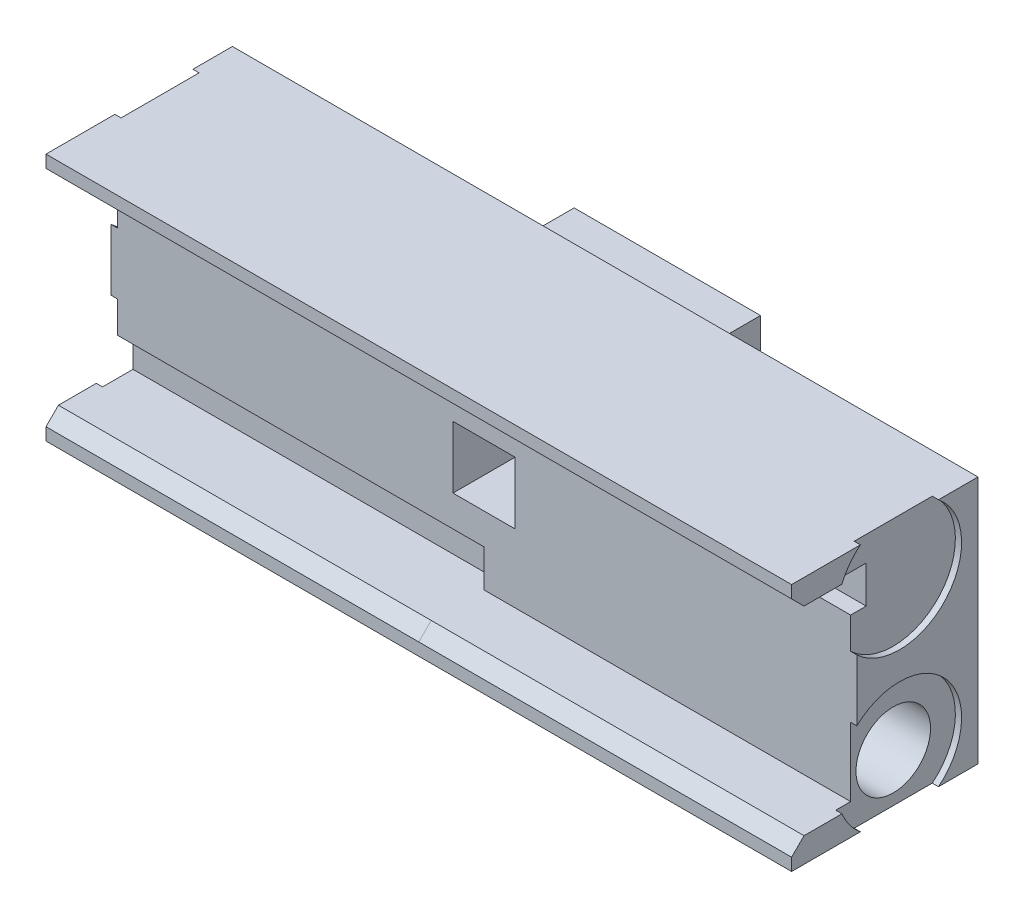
ISO-10303-21;
HEADER;
FILE_DESCRIPTION(('STEP AP214'),'2;1');
FILE_NAME('part.step','',(''),(''),'','','');
FILE_SCHEMA(('AUTOMOTIVE_DESIGN { 1 0 10303 214 1 1 1 1 }'));
ENDSEC;
DATA;
#1=APPLICATION_CONTEXT('core data for automotive mechanical design processes');
#2=APPLICATION_PROTOCOL_DEFINITION('international standard','automotive_design',2000,#1);
#3=PRODUCT_CONTEXT('',#1,'mechanical');
#4=PRODUCT('Part','Part','',(#3));
#5=PRODUCT_RELATED_PRODUCT_CATEGORY('part','',(#4));
#6=PRODUCT_DEFINITION_FORMATION('','',#4);
#7=PRODUCT_DEFINITION_CONTEXT('part definition',#1,'design');
#8=PRODUCT_DEFINITION('design','',#6,#7);
#9=PRODUCT_DEFINITION_SHAPE('','',#8);
#10=(LENGTH_UNIT() NAMED_UNIT(*) SI_UNIT(.MILLI.,.METRE.));
#11=(NAMED_UNIT(*) PLANE_ANGLE_UNIT() SI_UNIT($,.RADIAN.));
#12=(NAMED_UNIT(*) SI_UNIT($,.STERADIAN.) SOLID_ANGLE_UNIT());
#13=UNCERTAINTY_MEASURE_WITH_UNIT(LENGTH_MEASURE(1.E-05),#10,'distance_accuracy_value','');
#14=(GEOMETRIC_REPRESENTATION_CONTEXT(3) GLOBAL_UNCERTAINTY_ASSIGNED_CONTEXT((#13)) GLOBAL_UNIT_ASSIGNED_CONTEXT((#10,
#11,#12)) REPRESENTATION_CONTEXT('',''));
#15=CARTESIAN_POINT('',(0.,0.,0.));
#16=DIRECTION('',(0.,0.,1.));
#17=DIRECTION('',(1.,0.,0.));
#18=AXIS2_PLACEMENT_3D('',#15,#16,#17);
#19=CARTESIAN_POINT('',(-60.,20.,30.));
#20=DIRECTION('',(1.,0.,0.));
#21=DIRECTION('',(0.,0.,-1.));
#22=AXIS2_PLACEMENT_3D('',#19,#20,#21);
#23=PLANE('',#22);
#24=DIRECTION('',(0.,-1.,0.));
#25=VECTOR('',#24,1.);
#26=CARTESIAN_POINT('',(-60.,20.,30.));
#27=LINE('',#26,#25);
#28=CARTESIAN_POINT('',(-60.,-18.,30.));
#29=VERTEX_POINT('',#28);
#30=CARTESIAN_POINT('',(-60.,-20.,30.));
#31=VERTEX_POINT('',#30);
#32=EDGE_CURVE('E364',#29,#31,#27,.T.);
#33=ORIENTED_EDGE('',*,*,#32,.F.);
#34=DIRECTION('',(0.,0.707106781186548,-0.707106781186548));
#35=VECTOR('',#34,1.);
#36=CARTESIAN_POINT('',(-60.,-18.,30.));
#37=LINE('',#36,#35);
#38=CARTESIAN_POINT('',(-60.,-16.,28.));
#39=VERTEX_POINT('',#38);
#40=EDGE_CURVE('E458',#29,#39,#37,.T.);
#41=ORIENTED_EDGE('',*,*,#40,.T.);
#42=DIRECTION('',(0.,0.,1.));
#43=VECTOR('',#42,1.);
#44=CARTESIAN_POINT('',(-60.,-16.,30.));
#45=LINE('',#44,#43);
#46=CARTESIAN_POINT('',(-60.,-16.,21.8987230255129));
#47=VERTEX_POINT('',#46);
#48=EDGE_CURVE('E328',#47,#39,#45,.T.);
#49=ORIENTED_EDGE('',*,*,#48,.F.);
#50=CARTESIAN_POINT('',(-60.,-12.2191674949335,12.6410070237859));
#51=DIRECTION('',(1.,0.,0.));
#52=DIRECTION('',(0.,0.,1.));
#53=AXIS2_PLACEMENT_3D('',#50,#51,#52);
#54=CIRCLE('',#53,10.);
#55=CARTESIAN_POINT('',(-60.,-20.,18.9226187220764));
#56=VERTEX_POINT('',#55);
#57=EDGE_CURVE('E527',#47,#56,#54,.T.);
#58=ORIENTED_EDGE('',*,*,#57,.T.);
#59=DIRECTION('',(0.,0.,-1.));
#60=VECTOR('',#59,1.);
#61=CARTESIAN_POINT('',(-60.,-20.,30.));
#62=LINE('',#61,#60);
#63=EDGE_CURVE('E385',#31,#56,#62,.T.);
#64=ORIENTED_EDGE('',*,*,#63,.F.);
#65=EDGE_LOOP('',(#33,#41,#49,#58,#64));
#66=FACE_BOUND('',#65,.T.);
#67=ADVANCED_FACE('F35',(#66),#23,.F.);
#68=CARTESIAN_POINT('',(-60.,-20.,6.3593953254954));
#69=VERTEX_POINT('',#68);
#70=CARTESIAN_POINT('',(-60.,-4.94220278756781,19.5));
#71=VERTEX_POINT('',#70);
#72=EDGE_CURVE('E540',#69,#71,#54,.T.);
#73=ORIENTED_EDGE('',*,*,#72,.T.);
#74=DIRECTION('',(0.,-1.,0.));
#75=VECTOR('',#74,1.);
#76=CARTESIAN_POINT('',(-60.,-10.,19.5));
#77=LINE('',#76,#75);
#78=CARTESIAN_POINT('',(-60.,4.94220278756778,19.5));
#79=VERTEX_POINT('',#78);
#80=EDGE_CURVE('E469',#79,#71,#77,.T.);
#81=ORIENTED_EDGE('',*,*,#80,.F.);
#82=CARTESIAN_POINT('',(-60.,12.2191674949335,12.6410070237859));
#83=DIRECTION('',(1.,0.,0.));
#84=DIRECTION('',(0.,0.,-1.));
#85=AXIS2_PLACEMENT_3D('',#82,#83,#84);
#86=CIRCLE('',#85,10.);
#87=CARTESIAN_POINT('',(-60.,20.,6.3593953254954));
#88=VERTEX_POINT('',#87);
#89=EDGE_CURVE('E429',#88,#79,#86,.F.);
#90=ORIENTED_EDGE('',*,*,#89,.F.);
#91=DIRECTION('',(0.,0.,-1.));
#92=VECTOR('',#91,1.);
#93=CARTESIAN_POINT('',(-60.,20.,30.));
#94=LINE('',#93,#92);
#95=CARTESIAN_POINT('',(-60.,20.,0.));
#96=VERTEX_POINT('',#95);
#97=EDGE_CURVE('E388',#88,#96,#94,.T.);
#98=ORIENTED_EDGE('',*,*,#97,.T.);
#99=DIRECTION('',(0.,-1.,0.));
#100=VECTOR('',#99,1.);
#101=CARTESIAN_POINT('',(-60.,20.,0.));
#102=LINE('',#101,#100);
#103=CARTESIAN_POINT('',(-60.,-20.,0.));
#104=VERTEX_POINT('',#103);
#105=EDGE_CURVE('E375',#96,#104,#102,.T.);
#106=ORIENTED_EDGE('',*,*,#105,.T.);
#107=EDGE_CURVE('E384',#69,#104,#62,.T.);
#108=ORIENTED_EDGE('',*,*,#107,.F.);
#109=EDGE_LOOP('',(#73,#81,#90,#98,#106,#108));
#110=FACE_BOUND('',#109,.T.);
#111=ADVANCED_FACE('F673',(#110),#23,.F.);
#112=CARTESIAN_POINT('',(0.,0.,30.));
#113=DIRECTION('',(0.,0.,1.));
#114=DIRECTION('',(1.,0.,0.));
#115=AXIS2_PLACEMENT_3D('',#112,#113,#114);
#116=PLANE('',#115);
#117=DIRECTION('',(-1.,0.,0.));
#118=VECTOR('',#117,1.);
#119=CARTESIAN_POINT('',(0.,-18.0000000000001,30.));
#120=LINE('',#119,#118);
#121=CARTESIAN_POINT('',(60.,-18.0000000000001,30.));
#122=VERTEX_POINT('',#121);
#123=CARTESIAN_POINT('',(0.,-18.0000000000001,29.9999999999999));
#124=VERTEX_POINT('',#123);
#125=EDGE_CURVE('E407',#122,#124,#120,.T.);
#126=ORIENTED_EDGE('',*,*,#125,.T.);
#127=DIRECTION('',(-1.,0.,0.));
#128=VECTOR('',#127,1.);
#129=CARTESIAN_POINT('',(-60.,-18.,30.));
#130=LINE('',#129,#128);
#131=EDGE_CURVE('E455',#124,#29,#130,.T.);
#132=ORIENTED_EDGE('',*,*,#131,.T.);
#133=ORIENTED_EDGE('',*,*,#32,.T.);
#134=DIRECTION('',(1.,0.,0.));
#135=VECTOR('',#134,1.);
#136=CARTESIAN_POINT('',(-60.,-20.,30.));
#137=LINE('',#136,#135);
#138=CARTESIAN_POINT('',(60.,-20.,30.));
#139=VERTEX_POINT('',#138);
#140=EDGE_CURVE('E367',#31,#139,#137,.T.);
#141=ORIENTED_EDGE('',*,*,#140,.T.);
#142=DIRECTION('',(0.,1.,0.));
#143=VECTOR('',#142,1.);
#144=CARTESIAN_POINT('',(60.,20.,30.));
#145=LINE('',#144,#143);
#146=EDGE_CURVE('E358',#139,#122,#145,.T.);
#147=ORIENTED_EDGE('',*,*,#146,.T.);
#148=EDGE_LOOP('',(#126,#132,#133,#141,#147));
#149=FACE_BOUND('',#148,.T.);
#150=ADVANCED_FACE('F746',(#149),#116,.T.);
#151=CARTESIAN_POINT('',(0.,0.,0.));
#152=DIRECTION('',(1.,0.,0.));
#153=DIRECTION('',(0.,0.,-1.));
#154=AXIS2_PLACEMENT_3D('',#151,#152,#153);
#155=PLANE('',#154);
#156=DIRECTION('',(0.,-1.,0.));
#157=VECTOR('',#156,1.);
#158=CARTESIAN_POINT('',(0.,-10.,19.5));
#159=LINE('',#158,#157);
#160=CARTESIAN_POINT('',(0.,16.,19.5));
#161=VERTEX_POINT('',#160);
#162=CARTESIAN_POINT('',(0.,9.99999999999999,19.5));
#163=VERTEX_POINT('',#162);
#164=EDGE_CURVE('E317',#161,#163,#159,.T.);
#165=ORIENTED_EDGE('',*,*,#164,.T.);
#166=DIRECTION('',(0.,0.,-1.));
#167=VECTOR('',#166,1.);
#168=CARTESIAN_POINT('',(0.,9.99999999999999,17.));
#169=LINE('',#168,#167);
#170=CARTESIAN_POINT('',(0.,9.99999999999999,17.));
#171=VERTEX_POINT('',#170);
#172=EDGE_CURVE('E338',#163,#171,#169,.T.);
#173=ORIENTED_EDGE('',*,*,#172,.T.);
#174=DIRECTION('',(0.,1.,0.));
#175=VECTOR('',#174,1.);
#176=CARTESIAN_POINT('',(0.,16.,17.));
#177=LINE('',#176,#175);
#178=CARTESIAN_POINT('',(0.,16.,17.));
#179=VERTEX_POINT('',#178);
#180=EDGE_CURVE('E333',#171,#179,#177,.T.);
#181=ORIENTED_EDGE('',*,*,#180,.T.);
#182=DIRECTION('',(0.,0.,1.));
#183=VECTOR('',#182,1.);
#184=CARTESIAN_POINT('',(0.,16.,30.));
#185=LINE('',#184,#183);
#186=EDGE_CURVE('E308',#179,#161,#185,.T.);
#187=ORIENTED_EDGE('',*,*,#186,.T.);
#188=EDGE_LOOP('',(#165,#173,#181,#187));
#189=FACE_BOUND('',#188,.T.);
#190=ADVANCED_FACE('F331',(#189),#155,.T.);
#191=CARTESIAN_POINT('',(-59.,12.2191674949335,12.6410070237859));
#192=DIRECTION('',(-1.,0.,0.));
#193=DIRECTION('',(0.,0.,1.));
#194=AXIS2_PLACEMENT_3D('',#191,#192,#193);
#195=CYLINDRICAL_SURFACE('',#194,10.);
#196=DIRECTION('',(-1.,0.,0.));
#197=VECTOR('',#196,1.);
#198=CARTESIAN_POINT('',(-59.,4.94220278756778,19.5));
#199=LINE('',#198,#197);
#200=CARTESIAN_POINT('',(-59.,4.94220278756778,19.5));
#201=VERTEX_POINT('',#200);
#202=EDGE_CURVE('E494',#201,#79,#199,.T.);
#203=ORIENTED_EDGE('',*,*,#202,.F.);
#204=CARTESIAN_POINT('',(-59.,12.2191674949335,12.6410070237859));
#205=DIRECTION('',(1.,0.,0.));
#206=DIRECTION('',(0.,0.,-1.));
#207=AXIS2_PLACEMENT_3D('',#204,#205,#206);
#208=CIRCLE('',#207,10.);
#209=CARTESIAN_POINT('',(-59.,20.,6.3593953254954));
#210=VERTEX_POINT('',#209);
#211=EDGE_CURVE('E538',#201,#210,#208,.T.);
#212=ORIENTED_EDGE('',*,*,#211,.T.);
#213=DIRECTION('',(-1.,0.,0.));
#214=VECTOR('',#213,1.);
#215=CARTESIAN_POINT('',(-59.,20.,6.3593953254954));
#216=LINE('',#215,#214);
#217=EDGE_CURVE('E546',#210,#88,#216,.T.);
#218=ORIENTED_EDGE('',*,*,#217,.T.);
#219=ORIENTED_EDGE('',*,*,#89,.T.);
#220=EDGE_LOOP('',(#203,#212,#218,#219));
#221=FACE_BOUND('',#220,.T.);
#222=ADVANCED_FACE('F669',(#221),#195,.F.);
#223=CARTESIAN_POINT('',(-59.,-12.2191674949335,12.6410070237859));
#224=DIRECTION('',(-1.,0.,0.));
#225=DIRECTION('',(0.,0.,1.));
#226=AXIS2_PLACEMENT_3D('',#223,#224,#225);
#227=CYLINDRICAL_SURFACE('',#226,10.);
#228=DIRECTION('',(-1.,0.,0.));
#229=VECTOR('',#228,1.);
#230=CARTESIAN_POINT('',(-59.,-16.,21.8987230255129));
#231=LINE('',#230,#229);
#232=CARTESIAN_POINT('',(-59.,-16.,21.8987230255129));
#233=VERTEX_POINT('',#232);
#234=EDGE_CURVE('E498',#233,#47,#231,.T.);
#235=ORIENTED_EDGE('',*,*,#234,.F.);
#236=CARTESIAN_POINT('',(-59.,-12.2191674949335,12.6410070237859));
#237=DIRECTION('',(1.,0.,0.));
#238=DIRECTION('',(0.,0.,1.));
#239=AXIS2_PLACEMENT_3D('',#236,#237,#238);
#240=CIRCLE('',#239,10.);
#241=CARTESIAN_POINT('',(-59.,-20.,18.9226187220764));
#242=VERTEX_POINT('',#241);
#243=EDGE_CURVE('E539',#233,#242,#240,.T.);
#244=ORIENTED_EDGE('',*,*,#243,.T.);
#245=DIRECTION('',(-1.,0.,0.));
#246=VECTOR('',#245,1.);
#247=CARTESIAN_POINT('',(-59.,-20.,18.9226187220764));
#248=LINE('',#247,#246);
#249=EDGE_CURVE('E438',#242,#56,#248,.T.);
#250=ORIENTED_EDGE('',*,*,#249,.T.);
#251=ORIENTED_EDGE('',*,*,#57,.F.);
#252=EDGE_LOOP('',(#235,#244,#250,#251));
#253=FACE_BOUND('',#252,.T.);
#254=ADVANCED_FACE('F786',(#253),#227,.F.);
#255=CARTESIAN_POINT('',(-60.,-20.,30.));
#256=DIRECTION('',(0.,1.,0.));
#257=DIRECTION('',(0.,0.,1.));
#258=AXIS2_PLACEMENT_3D('',#255,#256,#257);
#259=PLANE('',#258);
#260=DIRECTION('',(-1.,0.,0.));
#261=VECTOR('',#260,1.);
#262=CARTESIAN_POINT('',(-59.,-20.,6.3593953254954));
#263=LINE('',#262,#261);
#264=CARTESIAN_POINT('',(-59.,-20.,6.3593953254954));
#265=VERTEX_POINT('',#264);
#266=EDGE_CURVE('E441',#69,#265,#263,.F.);
#267=ORIENTED_EDGE('',*,*,#266,.F.);
#268=ORIENTED_EDGE('',*,*,#107,.T.);
#269=DIRECTION('',(1.,0.,0.));
#270=VECTOR('',#269,1.);
#271=CARTESIAN_POINT('',(-60.,-20.,0.));
#272=LINE('',#271,#270);
#273=CARTESIAN_POINT('',(60.,-20.,0.));
#274=VERTEX_POINT('',#273);
#275=EDGE_CURVE('E378',#104,#274,#272,.T.);
#276=ORIENTED_EDGE('',*,*,#275,.T.);
#277=DIRECTION('',(0.,0.,-1.));
#278=VECTOR('',#277,1.);
#279=CARTESIAN_POINT('',(60.,-20.,30.));
#280=LINE('',#279,#278);
#281=CARTESIAN_POINT('',(60.,-20.,6.3593953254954));
#282=VERTEX_POINT('',#281);
#283=EDGE_CURVE('E369',#282,#274,#280,.T.);
#284=ORIENTED_EDGE('',*,*,#283,.F.);
#285=DIRECTION('',(1.,0.,0.));
#286=VECTOR('',#285,1.);
#287=CARTESIAN_POINT('',(59.,-20.,6.3593953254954));
#288=LINE('',#287,#286);
#289=CARTESIAN_POINT('',(59.,-20.,6.3593953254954));
#290=VERTEX_POINT('',#289);
#291=EDGE_CURVE('E566',#282,#290,#288,.F.);
#292=ORIENTED_EDGE('',*,*,#291,.T.);
#293=DIRECTION('',(0.,0.,1.));
#294=VECTOR('',#293,1.);
#295=CARTESIAN_POINT('',(59.,-20.,30.));
#296=LINE('',#295,#294);
#297=CARTESIAN_POINT('',(59.,-20.,18.9226187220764));
#298=VERTEX_POINT('',#297);
#299=EDGE_CURVE('E560',#290,#298,#296,.T.);
#300=ORIENTED_EDGE('',*,*,#299,.T.);
#301=DIRECTION('',(1.,0.,0.));
#302=VECTOR('',#301,1.);
#303=CARTESIAN_POINT('',(59.,-20.,18.9226187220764));
#304=LINE('',#303,#302);
#305=CARTESIAN_POINT('',(60.,-20.,18.9226187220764));
#306=VERTEX_POINT('',#305);
#307=EDGE_CURVE('E569',#298,#306,#304,.T.);
#308=ORIENTED_EDGE('',*,*,#307,.T.);
#309=EDGE_CURVE('E381',#139,#306,#280,.T.);
#310=ORIENTED_EDGE('',*,*,#309,.F.);
#311=ORIENTED_EDGE('',*,*,#140,.F.);
#312=ORIENTED_EDGE('',*,*,#63,.T.);
#313=ORIENTED_EDGE('',*,*,#249,.F.);
#314=DIRECTION('',(0.,0.,-1.));
#315=VECTOR('',#314,1.);
#316=CARTESIAN_POINT('',(-59.,-20.,30.));
#317=LINE('',#316,#315);
#318=EDGE_CURVE('E435',#242,#265,#317,.T.);
#319=ORIENTED_EDGE('',*,*,#318,.T.);
#320=EDGE_LOOP('',(#267,#268,#276,#284,#292,#300,#308,#310,#311,#312,#313,#319));
#321=FACE_BOUND('',#320,.T.);
#322=ADVANCED_FACE('F685',(#321),#259,.F.);
#323=CARTESIAN_POINT('',(-60.,20.,30.));
#324=DIRECTION('',(0.,-1.,0.));
#325=DIRECTION('',(0.,0.,-1.));
#326=AXIS2_PLACEMENT_3D('',#323,#324,#325);
#327=PLANE('',#326);
#328=DIRECTION('',(-1.,0.,0.));
#329=VECTOR('',#328,1.);
#330=CARTESIAN_POINT('',(-59.,20.,18.9226187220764));
#331=LINE('',#330,#329);
#332=CARTESIAN_POINT('',(-60.,20.,18.9226187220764));
#333=VERTEX_POINT('',#332);
#334=CARTESIAN_POINT('',(-59.,20.,18.9226187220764));
#335=VERTEX_POINT('',#334);
#336=EDGE_CURVE('E548',#333,#335,#331,.F.);
#337=ORIENTED_EDGE('',*,*,#336,.F.);
#338=CARTESIAN_POINT('',(-60.,20.,30.));
#339=VERTEX_POINT('',#338);
#340=EDGE_CURVE('E389',#339,#333,#94,.T.);
#341=ORIENTED_EDGE('',*,*,#340,.F.);
#342=DIRECTION('',(-1.,0.,0.));
#343=VECTOR('',#342,1.);
#344=CARTESIAN_POINT('',(-60.,20.,30.));
#345=LINE('',#344,#343);
#346=CARTESIAN_POINT('',(60.,20.,30.));
#347=VERTEX_POINT('',#346);
#348=EDGE_CURVE('E361',#347,#339,#345,.T.);
#349=ORIENTED_EDGE('',*,*,#348,.F.);
#350=DIRECTION('',(0.,0.,-1.));
#351=VECTOR('',#350,1.);
#352=CARTESIAN_POINT('',(60.,20.,30.));
#353=LINE('',#352,#351);
#354=CARTESIAN_POINT('',(60.,20.,18.9226187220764));
#355=VERTEX_POINT('',#354);
#356=EDGE_CURVE('E393',#347,#355,#353,.T.);
#357=ORIENTED_EDGE('',*,*,#356,.T.);
#358=DIRECTION('',(1.,0.,0.));
#359=VECTOR('',#358,1.);
#360=CARTESIAN_POINT('',(59.,20.,18.9226187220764));
#361=LINE('',#360,#359);
#362=CARTESIAN_POINT('',(59.,20.,18.9226187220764));
#363=VERTEX_POINT('',#362);
#364=EDGE_CURVE('E590',#355,#363,#361,.F.);
#365=ORIENTED_EDGE('',*,*,#364,.T.);
#366=DIRECTION('',(0.,0.,1.));
#367=VECTOR('',#366,1.);
#368=CARTESIAN_POINT('',(59.,20.,30.));
#369=LINE('',#368,#367);
#370=CARTESIAN_POINT('',(59.,20.,6.3593953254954));
#371=VERTEX_POINT('',#370);
#372=EDGE_CURVE('E585',#371,#363,#369,.T.);
#373=ORIENTED_EDGE('',*,*,#372,.F.);
#374=DIRECTION('',(1.,0.,0.));
#375=VECTOR('',#374,1.);
#376=CARTESIAN_POINT('',(59.,20.,6.3593953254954));
#377=LINE('',#376,#375);
#378=CARTESIAN_POINT('',(60.,20.,6.3593953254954));
#379=VERTEX_POINT('',#378);
#380=EDGE_CURVE('E593',#371,#379,#377,.T.);
#381=ORIENTED_EDGE('',*,*,#380,.T.);
#382=CARTESIAN_POINT('',(60.,20.,0.));
#383=VERTEX_POINT('',#382);
#384=EDGE_CURVE('E392',#379,#383,#353,.T.);
#385=ORIENTED_EDGE('',*,*,#384,.T.);
#386=DIRECTION('',(-1.,0.,0.));
#387=VECTOR('',#386,1.);
#388=CARTESIAN_POINT('',(-60.,20.,0.));
#389=LINE('',#388,#387);
#390=EDGE_CURVE('E372',#383,#96,#389,.T.);
#391=ORIENTED_EDGE('',*,*,#390,.T.);
#392=ORIENTED_EDGE('',*,*,#97,.F.);
#393=ORIENTED_EDGE('',*,*,#217,.F.);
#394=DIRECTION('',(0.,0.,-1.));
#395=VECTOR('',#394,1.);
#396=CARTESIAN_POINT('',(-59.,20.,30.));
#397=LINE('',#396,#395);
#398=EDGE_CURVE('E432',#335,#210,#397,.T.);
#399=ORIENTED_EDGE('',*,*,#398,.F.);
#400=EDGE_LOOP('',(#337,#341,#349,#357,#365,#373,#381,#385,#391,#392,#393,#399));
#401=FACE_BOUND('',#400,.T.);
#402=ADVANCED_FACE('F646',(#401),#327,.F.);
#403=CARTESIAN_POINT('',(60.,20.,30.));
#404=DIRECTION('',(-1.,0.,0.));
#405=DIRECTION('',(0.,0.,1.));
#406=AXIS2_PLACEMENT_3D('',#403,#404,#405);
#407=PLANE('',#406);
#408=DIRECTION('',(0.,1.,0.));
#409=VECTOR('',#408,1.);
#410=CARTESIAN_POINT('',(60.,9.99999999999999,19.5));
#411=LINE('',#410,#409);
#412=CARTESIAN_POINT('',(60.,-4.94220278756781,19.5));
#413=VERTEX_POINT('',#412);
#414=CARTESIAN_POINT('',(60.,4.94220278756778,19.5));
#415=VERTEX_POINT('',#414);
#416=EDGE_CURVE('E345',#413,#415,#411,.T.);
#417=ORIENTED_EDGE('',*,*,#416,.F.);
#418=CARTESIAN_POINT('',(60.,-12.2191674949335,12.6410070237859));
#419=DIRECTION('',(1.,0.,0.));
#420=DIRECTION('',(0.,0.,1.));
#421=AXIS2_PLACEMENT_3D('',#418,#419,#420);
#422=CIRCLE('',#421,10.);
#423=EDGE_CURVE('E550',#282,#413,#422,.T.);
#424=ORIENTED_EDGE('',*,*,#423,.F.);
#425=ORIENTED_EDGE('',*,*,#283,.T.);
#426=DIRECTION('',(0.,1.,0.));
#427=VECTOR('',#426,1.);
#428=CARTESIAN_POINT('',(60.,20.,0.));
#429=LINE('',#428,#427);
#430=EDGE_CURVE('E353',#274,#383,#429,.T.);
#431=ORIENTED_EDGE('',*,*,#430,.T.);
#432=ORIENTED_EDGE('',*,*,#384,.F.);
#433=CARTESIAN_POINT('',(60.,12.2191674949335,12.6410070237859));
#434=DIRECTION('',(1.,0.,0.));
#435=DIRECTION('',(0.,0.,-1.));
#436=AXIS2_PLACEMENT_3D('',#433,#434,#435);
#437=CIRCLE('',#436,10.);
#438=EDGE_CURVE('E572',#415,#379,#437,.T.);
#439=ORIENTED_EDGE('',*,*,#438,.F.);
#440=EDGE_LOOP('',(#417,#424,#425,#431,#432,#439));
#441=FACE_BOUND('',#440,.T.);
#442=ADVANCED_FACE('F759',(#441),#407,.F.);
#443=DIRECTION('',(0.,0.,1.));
#444=VECTOR('',#443,1.);
#445=CARTESIAN_POINT('',(60.,16.,30.));
#446=LINE('',#445,#444);
#447=CARTESIAN_POINT('',(60.,16.,21.8987230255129));
#448=VERTEX_POINT('',#447);
#449=CARTESIAN_POINT('',(60.,16.,28.));
#450=VERTEX_POINT('',#449);
#451=EDGE_CURVE('E348',#448,#450,#446,.T.);
#452=ORIENTED_EDGE('',*,*,#451,.F.);
#453=EDGE_CURVE('E577',#355,#448,#437,.T.);
#454=ORIENTED_EDGE('',*,*,#453,.F.);
#455=ORIENTED_EDGE('',*,*,#356,.F.);
#456=CARTESIAN_POINT('',(60.,18.,30.));
#457=VERTEX_POINT('',#456);
#458=EDGE_CURVE('E362',#457,#347,#145,.T.);
#459=ORIENTED_EDGE('',*,*,#458,.F.);
#460=DIRECTION('',(0.,-0.707106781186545,-0.70710678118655));
#461=VECTOR('',#460,1.);
#462=CARTESIAN_POINT('',(60.,18.,30.));
#463=LINE('',#462,#461);
#464=EDGE_CURVE('E399',#457,#450,#463,.T.);
#465=ORIENTED_EDGE('',*,*,#464,.T.);
#466=EDGE_LOOP('',(#452,#454,#455,#459,#465));
#467=FACE_BOUND('',#466,.T.);
#468=ADVANCED_FACE('F652',(#467),#407,.F.);
#469=CARTESIAN_POINT('',(0.,16.,17.));
#470=DIRECTION('',(0.,0.,-1.));
#471=DIRECTION('',(0.,1.,0.));
#472=AXIS2_PLACEMENT_3D('',#469,#470,#471);
#473=PLANE('',#472);
#474=DIRECTION('',(0.,-1.,0.));
#475=VECTOR('',#474,1.);
#476=CARTESIAN_POINT('',(59.,16.,17.));
#477=LINE('',#476,#475);
#478=CARTESIAN_POINT('',(59.,16.,17.));
#479=VERTEX_POINT('',#478);
#480=CARTESIAN_POINT('',(59.,9.99999999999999,17.));
#481=VERTEX_POINT('',#480);
#482=EDGE_CURVE('E581',#479,#481,#477,.T.);
#483=ORIENTED_EDGE('',*,*,#482,.F.);
#484=DIRECTION('',(1.,0.,0.));
#485=VECTOR('',#484,1.);
#486=CARTESIAN_POINT('',(0.,16.,17.));
#487=LINE('',#486,#485);
#488=EDGE_CURVE('E351',#179,#479,#487,.T.);
#489=ORIENTED_EDGE('',*,*,#488,.F.);
#490=ORIENTED_EDGE('',*,*,#180,.F.);
#491=DIRECTION('',(1.,0.,0.));
#492=VECTOR('',#491,1.);
#493=CARTESIAN_POINT('',(0.,9.99999999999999,17.));
#494=LINE('',#493,#492);
#495=EDGE_CURVE('E354',#171,#481,#494,.T.);
#496=ORIENTED_EDGE('',*,*,#495,.T.);
#497=EDGE_LOOP('',(#483,#489,#490,#496));
#498=FACE_BOUND('',#497,.T.);
#499=ADVANCED_FACE('F633',(#498),#473,.F.);
#500=CARTESIAN_POINT('',(0.,9.99999999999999,17.));
#501=DIRECTION('',(0.,-1.,0.));
#502=DIRECTION('',(0.,0.,-1.));
#503=AXIS2_PLACEMENT_3D('',#500,#501,#502);
#504=PLANE('',#503);
#505=DIRECTION('',(0.,0.,1.));
#506=VECTOR('',#505,1.);
#507=CARTESIAN_POINT('',(59.,9.99999999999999,17.));
#508=LINE('',#507,#506);
#509=CARTESIAN_POINT('',(59.,9.99999999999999,19.5));
#510=VERTEX_POINT('',#509);
#511=EDGE_CURVE('E579',#481,#510,#508,.T.);
#512=ORIENTED_EDGE('',*,*,#511,.F.);
#513=ORIENTED_EDGE('',*,*,#495,.F.);
#514=ORIENTED_EDGE('',*,*,#172,.F.);
#515=DIRECTION('',(1.,0.,0.));
#516=VECTOR('',#515,1.);
#517=CARTESIAN_POINT('',(0.,9.99999999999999,19.5));
#518=LINE('',#517,#516);
#519=EDGE_CURVE('E323',#163,#510,#518,.T.);
#520=ORIENTED_EDGE('',*,*,#519,.T.);
#521=EDGE_LOOP('',(#512,#513,#514,#520));
#522=FACE_BOUND('',#521,.T.);
#523=ADVANCED_FACE('F630',(#522),#504,.F.);
#524=CARTESIAN_POINT('',(0.,0.,0.));
#525=DIRECTION('',(0.,0.,1.));
#526=DIRECTION('',(1.,0.,0.));
#527=AXIS2_PLACEMENT_3D('',#524,#525,#526);
#528=PLANE('',#527);
#529=ORIENTED_EDGE('',*,*,#430,.F.);
#530=ORIENTED_EDGE('',*,*,#275,.F.);
#531=ORIENTED_EDGE('',*,*,#105,.F.);
#532=ORIENTED_EDGE('',*,*,#390,.F.);
#533=EDGE_LOOP('',(#529,#530,#531,#532));
#534=FACE_BOUND('',#533,.T.);
#535=DIRECTION('',(0.,1.,0.));
#536=VECTOR('',#535,1.);
#537=CARTESIAN_POINT('',(-15.,15.,0.));
#538=LINE('',#537,#536);
#539=CARTESIAN_POINT('',(-15.,-15.,0.));
#540=VERTEX_POINT('',#539);
#541=CARTESIAN_POINT('',(-15.,15.,0.));
#542=VERTEX_POINT('',#541);
#543=EDGE_CURVE('E596',#540,#542,#538,.T.);
#544=ORIENTED_EDGE('',*,*,#543,.F.);
#545=DIRECTION('',(-1.,0.,0.));
#546=VECTOR('',#545,1.);
#547=CARTESIAN_POINT('',(15.,-15.,0.));
#548=LINE('',#547,#546);
#549=CARTESIAN_POINT('',(15.,-15.,0.));
#550=VERTEX_POINT('',#549);
#551=EDGE_CURVE('E601',#550,#540,#548,.T.);
#552=ORIENTED_EDGE('',*,*,#551,.F.);
#553=DIRECTION('',(0.,-1.,0.));
#554=VECTOR('',#553,1.);
#555=CARTESIAN_POINT('',(15.,15.,0.));
#556=LINE('',#555,#554);
#557=CARTESIAN_POINT('',(15.,15.,0.));
#558=VERTEX_POINT('',#557);
#559=EDGE_CURVE('E613',#558,#550,#556,.T.);
#560=ORIENTED_EDGE('',*,*,#559,.F.);
#561=DIRECTION('',(1.,0.,0.));
#562=VECTOR('',#561,1.);
#563=CARTESIAN_POINT('',(15.,15.,0.));
#564=LINE('',#563,#562);
#565=EDGE_CURVE('E610',#542,#558,#564,.T.);
#566=ORIENTED_EDGE('',*,*,#565,.F.);
#567=EDGE_LOOP('',(#544,#552,#560,#566));
#568=FACE_BOUND('',#567,.T.);
#569=ADVANCED_FACE('F680',(#534,#568),#528,.F.);
#570=ORIENTED_EDGE('',*,*,#309,.T.);
#571=CARTESIAN_POINT('',(60.,-16.,21.8987230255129));
#572=VERTEX_POINT('',#571);
#573=EDGE_CURVE('E556',#572,#306,#422,.T.);
#574=ORIENTED_EDGE('',*,*,#573,.F.);
#575=DIRECTION('',(0.,0.,-1.));
#576=VECTOR('',#575,1.);
#577=CARTESIAN_POINT('',(60.,-16.,29.9999999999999));
#578=LINE('',#577,#576);
#579=CARTESIAN_POINT('',(60.,-16.,27.9999999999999));
#580=VERTEX_POINT('',#579);
#581=EDGE_CURVE('E342',#580,#572,#578,.T.);
#582=ORIENTED_EDGE('',*,*,#581,.F.);
#583=DIRECTION('',(0.,-0.707106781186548,0.707106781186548));
#584=VECTOR('',#583,1.);
#585=CARTESIAN_POINT('',(60.,-16.,27.9999999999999));
#586=LINE('',#585,#584);
#587=EDGE_CURVE('E402',#580,#122,#586,.T.);
#588=ORIENTED_EDGE('',*,*,#587,.T.);
#589=ORIENTED_EDGE('',*,*,#146,.F.);
#590=EDGE_LOOP('',(#570,#574,#582,#588,#589));
#591=FACE_BOUND('',#590,.T.);
#592=ADVANCED_FACE('F751',(#591),#407,.F.);
#593=DIRECTION('',(0.,0.,-1.));
#594=VECTOR('',#593,1.);
#595=CARTESIAN_POINT('',(-60.,16.,19.5));
#596=LINE('',#595,#594);
#597=CARTESIAN_POINT('',(-60.,16.,28.));
#598=VERTEX_POINT('',#597);
#599=CARTESIAN_POINT('',(-60.,16.,21.8987230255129));
#600=VERTEX_POINT('',#599);
#601=EDGE_CURVE('E463',#598,#600,#596,.T.);
#602=ORIENTED_EDGE('',*,*,#601,.F.);
#603=DIRECTION('',(0.,0.70710678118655,0.707106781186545));
#604=VECTOR('',#603,1.);
#605=CARTESIAN_POINT('',(-60.,16.,28.));
#606=LINE('',#605,#604);
#607=CARTESIAN_POINT('',(-60.,18.,30.));
#608=VERTEX_POINT('',#607);
#609=EDGE_CURVE('E43',#598,#608,#606,.T.);
#610=ORIENTED_EDGE('',*,*,#609,.T.);
#611=EDGE_CURVE('E365',#339,#608,#27,.T.);
#612=ORIENTED_EDGE('',*,*,#611,.F.);
#613=ORIENTED_EDGE('',*,*,#340,.T.);
#614=EDGE_CURVE('E428',#600,#333,#86,.F.);
#615=ORIENTED_EDGE('',*,*,#614,.F.);
#616=EDGE_LOOP('',(#602,#610,#612,#613,#615));
#617=FACE_BOUND('',#616,.T.);
#618=ADVANCED_FACE('F468',(#617),#23,.F.);
#619=ORIENTED_EDGE('',*,*,#611,.T.);
#620=DIRECTION('',(1.,0.,0.));
#621=VECTOR('',#620,1.);
#622=CARTESIAN_POINT('',(0.,18.,30.));
#623=LINE('',#622,#621);
#624=CARTESIAN_POINT('',(0.,18.,30.));
#625=VERTEX_POINT('',#624);
#626=EDGE_CURVE('E11',#608,#625,#623,.T.);
#627=ORIENTED_EDGE('',*,*,#626,.T.);
#628=DIRECTION('',(1.,0.,0.));
#629=VECTOR('',#628,1.);
#630=CARTESIAN_POINT('',(60.,18.,30.));
#631=LINE('',#630,#629);
#632=EDGE_CURVE('E404',#625,#457,#631,.T.);
#633=ORIENTED_EDGE('',*,*,#632,.T.);
#634=ORIENTED_EDGE('',*,*,#458,.T.);
#635=ORIENTED_EDGE('',*,*,#348,.T.);
#636=EDGE_LOOP('',(#619,#627,#633,#634,#635));
#637=FACE_BOUND('',#636,.T.);
#638=ADVANCED_FACE('F657',(#637),#116,.T.);
#639=CARTESIAN_POINT('',(0.,16.,30.));
#640=DIRECTION('',(0.,1.,0.));
#641=DIRECTION('',(0.,0.,1.));
#642=AXIS2_PLACEMENT_3D('',#639,#640,#641);
#643=PLANE('',#642);
#644=DIRECTION('',(-1.,0.,0.));
#645=VECTOR('',#644,1.);
#646=CARTESIAN_POINT('',(0.,16.,28.));
#647=LINE('',#646,#645);
#648=CARTESIAN_POINT('',(0.,16.,28.));
#649=VERTEX_POINT('',#648);
#650=EDGE_CURVE('E409',#450,#649,#647,.T.);
#651=ORIENTED_EDGE('',*,*,#650,.T.);
#652=DIRECTION('',(-1.,0.,0.));
#653=VECTOR('',#652,1.);
#654=CARTESIAN_POINT('',(-60.,16.,28.));
#655=LINE('',#654,#653);
#656=EDGE_CURVE('E462',#649,#598,#655,.T.);
#657=ORIENTED_EDGE('',*,*,#656,.T.);
#658=ORIENTED_EDGE('',*,*,#601,.T.);
#659=DIRECTION('',(-1.,0.,0.));
#660=VECTOR('',#659,1.);
#661=CARTESIAN_POINT('',(-59.,16.,21.8987230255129));
#662=LINE('',#661,#660);
#663=CARTESIAN_POINT('',(-59.,16.,21.8987230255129));
#664=VERTEX_POINT('',#663);
#665=EDGE_CURVE('E453',#600,#664,#662,.F.);
#666=ORIENTED_EDGE('',*,*,#665,.T.);
#667=DIRECTION('',(0.,0.,-1.));
#668=VECTOR('',#667,1.);
#669=CARTESIAN_POINT('',(-59.,16.,12.6410070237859));
#670=LINE('',#669,#668);
#671=CARTESIAN_POINT('',(-59.,16.,19.5));
#672=VERTEX_POINT('',#671);
#673=EDGE_CURVE('E310',#664,#672,#670,.T.);
#674=ORIENTED_EDGE('',*,*,#673,.T.);
#675=DIRECTION('',(-1.,0.,0.));
#676=VECTOR('',#675,1.);
#677=CARTESIAN_POINT('',(0.,16.,19.5));
#678=LINE('',#677,#676);
#679=EDGE_CURVE('E303',#161,#672,#678,.T.);
#680=ORIENTED_EDGE('',*,*,#679,.F.);
#681=ORIENTED_EDGE('',*,*,#186,.F.);
#682=ORIENTED_EDGE('',*,*,#488,.T.);
#683=DIRECTION('',(0.,0.,-1.));
#684=VECTOR('',#683,1.);
#685=CARTESIAN_POINT('',(59.,16.,30.));
#686=LINE('',#685,#684);
#687=CARTESIAN_POINT('',(59.,16.,21.8987230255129));
#688=VERTEX_POINT('',#687);
#689=EDGE_CURVE('E583',#688,#479,#686,.T.);
#690=ORIENTED_EDGE('',*,*,#689,.F.);
#691=DIRECTION('',(1.,0.,0.));
#692=VECTOR('',#691,1.);
#693=CARTESIAN_POINT('',(59.,16.,21.8987230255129));
#694=LINE('',#693,#692);
#695=EDGE_CURVE('E587',#688,#448,#694,.T.);
#696=ORIENTED_EDGE('',*,*,#695,.T.);
#697=ORIENTED_EDGE('',*,*,#451,.T.);
#698=EDGE_LOOP('',(#651,#657,#658,#666,#674,#680,#681,#682,#690,#696,#697));
#699=FACE_BOUND('',#698,.T.);
#700=ADVANCED_FACE('F305',(#699),#643,.F.);
#701=CARTESIAN_POINT('',(0.,9.99999999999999,19.5));
#702=DIRECTION('',(0.,0.,-1.));
#703=DIRECTION('',(-1.,0.,0.));
#704=AXIS2_PLACEMENT_3D('',#701,#702,#703);
#705=PLANE('',#704);
#706=DIRECTION('',(-1.,0.,0.));
#707=VECTOR('',#706,1.);
#708=CARTESIAN_POINT('',(0.,-10.,19.5));
#709=LINE('',#708,#707);
#710=CARTESIAN_POINT('',(0.,-10.,19.5));
#711=VERTEX_POINT('',#710);
#712=CARTESIAN_POINT('',(-59.,-10.,19.5));
#713=VERTEX_POINT('',#712);
#714=EDGE_CURVE('E313',#711,#713,#709,.T.);
#715=ORIENTED_EDGE('',*,*,#714,.F.);
#716=DIRECTION('',(0.,1.,0.));
#717=VECTOR('',#716,1.);
#718=CARTESIAN_POINT('',(0.,-9.99999999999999,19.5));
#719=LINE('',#718,#717);
#720=CARTESIAN_POINT('',(0.,-16.,19.5));
#721=VERTEX_POINT('',#720);
#722=EDGE_CURVE('E350',#721,#711,#719,.T.);
#723=ORIENTED_EDGE('',*,*,#722,.F.);
#724=DIRECTION('',(1.,0.,0.));
#725=VECTOR('',#724,1.);
#726=CARTESIAN_POINT('',(0.,-16.,19.5));
#727=LINE('',#726,#725);
#728=CARTESIAN_POINT('',(59.,-16.,19.5));
#729=VERTEX_POINT('',#728);
#730=EDGE_CURVE('E334',#721,#729,#727,.T.);
#731=ORIENTED_EDGE('',*,*,#730,.T.);
#732=DIRECTION('',(0.,1.,0.));
#733=VECTOR('',#732,1.);
#734=CARTESIAN_POINT('',(59.,9.99999999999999,19.5));
#735=LINE('',#734,#733);
#736=CARTESIAN_POINT('',(59.,-4.94220278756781,19.5));
#737=VERTEX_POINT('',#736);
#738=EDGE_CURVE('E554',#729,#737,#735,.T.);
#739=ORIENTED_EDGE('',*,*,#738,.T.);
#740=DIRECTION('',(1.,0.,0.));
#741=VECTOR('',#740,1.);
#742=CARTESIAN_POINT('',(59.,-4.94220278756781,19.5));
#743=LINE('',#742,#741);
#744=EDGE_CURVE('E563',#737,#413,#743,.T.);
#745=ORIENTED_EDGE('',*,*,#744,.T.);
#746=ORIENTED_EDGE('',*,*,#416,.T.);
#747=DIRECTION('',(1.,0.,0.));
#748=VECTOR('',#747,1.);
#749=CARTESIAN_POINT('',(59.,4.94220278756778,19.5));
#750=LINE('',#749,#748);
#751=CARTESIAN_POINT('',(59.,4.94220278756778,19.5));
#752=VERTEX_POINT('',#751);
#753=EDGE_CURVE('E419',#415,#752,#750,.F.);
#754=ORIENTED_EDGE('',*,*,#753,.T.);
#755=DIRECTION('',(0.,-1.,0.));
#756=VECTOR('',#755,1.);
#757=CARTESIAN_POINT('',(59.,9.99999999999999,19.5));
#758=LINE('',#757,#756);
#759=EDGE_CURVE('E417',#510,#752,#758,.T.);
#760=ORIENTED_EDGE('',*,*,#759,.F.);
#761=ORIENTED_EDGE('',*,*,#519,.F.);
#762=ORIENTED_EDGE('',*,*,#164,.F.);
#763=ORIENTED_EDGE('',*,*,#679,.T.);
#764=DIRECTION('',(0.,-1.,0.));
#765=VECTOR('',#764,1.);
#766=CARTESIAN_POINT('',(-59.,12.2191674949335,19.5));
#767=LINE('',#766,#765);
#768=EDGE_CURVE('E496',#672,#201,#767,.T.);
#769=ORIENTED_EDGE('',*,*,#768,.T.);
#770=ORIENTED_EDGE('',*,*,#202,.T.);
#771=ORIENTED_EDGE('',*,*,#80,.T.);
#772=DIRECTION('',(-1.,0.,0.));
#773=VECTOR('',#772,1.);
#774=CARTESIAN_POINT('',(-59.,-4.94220278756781,19.5));
#775=LINE('',#774,#773);
#776=CARTESIAN_POINT('',(-59.,-4.94220278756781,19.5));
#777=VERTEX_POINT('',#776);
#778=EDGE_CURVE('E492',#71,#777,#775,.F.);
#779=ORIENTED_EDGE('',*,*,#778,.T.);
#780=DIRECTION('',(0.,1.,0.));
#781=VECTOR('',#780,1.);
#782=CARTESIAN_POINT('',(-59.,-12.2191674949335,19.5));
#783=LINE('',#782,#781);
#784=EDGE_CURVE('E484',#713,#777,#783,.T.);
#785=ORIENTED_EDGE('',*,*,#784,.F.);
#786=EDGE_LOOP('',(#715,#723,#731,#739,#745,#746,#754,#760,#761,#762,#763,#769,#770,#771,#779,#785));
#787=FACE_BOUND('',#786,.T.);
#788=DIRECTION('',(0.,1.,0.));
#789=VECTOR('',#788,1.);
#790=CARTESIAN_POINT('',(5.,5.00000000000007,19.5));
#791=LINE('',#790,#789);
#792=CARTESIAN_POINT('',(5.,-4.99999999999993,19.5));
#793=VERTEX_POINT('',#792);
#794=CARTESIAN_POINT('',(5.,5.00000000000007,19.5));
#795=VERTEX_POINT('',#794);
#796=EDGE_CURVE('E501',#793,#795,#791,.T.);
#797=ORIENTED_EDGE('',*,*,#796,.F.);
#798=DIRECTION('',(1.,0.,0.));
#799=VECTOR('',#798,1.);
#800=CARTESIAN_POINT('',(-5.,-4.99999999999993,19.5));
#801=LINE('',#800,#799);
#802=CARTESIAN_POINT('',(-5.,-4.99999999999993,19.5));
#803=VERTEX_POINT('',#802);
#804=EDGE_CURVE('E506',#803,#793,#801,.T.);
#805=ORIENTED_EDGE('',*,*,#804,.F.);
#806=DIRECTION('',(0.,-1.,0.));
#807=VECTOR('',#806,1.);
#808=CARTESIAN_POINT('',(-5.,5.00000000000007,19.5));
#809=LINE('',#808,#807);
#810=CARTESIAN_POINT('',(-5.,5.00000000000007,19.5));
#811=VERTEX_POINT('',#810);
#812=EDGE_CURVE('E520',#811,#803,#809,.T.);
#813=ORIENTED_EDGE('',*,*,#812,.F.);
#814=DIRECTION('',(-1.,0.,0.));
#815=VECTOR('',#814,1.);
#816=CARTESIAN_POINT('',(-5.,5.00000000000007,19.5));
#817=LINE('',#816,#815);
#818=EDGE_CURVE('E518',#795,#811,#817,.T.);
#819=ORIENTED_EDGE('',*,*,#818,.F.);
#820=EDGE_LOOP('',(#797,#805,#813,#819));
#821=FACE_BOUND('',#820,.T.);
#822=ADVANCED_FACE('F319',(#787,#821),#705,.F.);
#823=CARTESIAN_POINT('',(0.,-16.,29.9999999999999));
#824=DIRECTION('',(0.,-1.,0.));
#825=DIRECTION('',(0.,0.,-1.));
#826=AXIS2_PLACEMENT_3D('',#823,#824,#825);
#827=PLANE('',#826);
#828=ORIENTED_EDGE('',*,*,#48,.T.);
#829=DIRECTION('',(1.,0.,0.));
#830=VECTOR('',#829,1.);
#831=CARTESIAN_POINT('',(0.,-16.,28.));
#832=LINE('',#831,#830);
#833=CARTESIAN_POINT('',(0.,-16.,27.9999999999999));
#834=VERTEX_POINT('',#833);
#835=EDGE_CURVE('E460',#39,#834,#832,.T.);
#836=ORIENTED_EDGE('',*,*,#835,.T.);
#837=DIRECTION('',(1.,0.,0.));
#838=VECTOR('',#837,1.);
#839=CARTESIAN_POINT('',(60.,-16.,27.9999999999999));
#840=LINE('',#839,#838);
#841=EDGE_CURVE('E396',#834,#580,#840,.T.);
#842=ORIENTED_EDGE('',*,*,#841,.T.);
#843=ORIENTED_EDGE('',*,*,#581,.T.);
#844=DIRECTION('',(1.,0.,0.));
#845=VECTOR('',#844,1.);
#846=CARTESIAN_POINT('',(59.,-16.,21.8987230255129));
#847=LINE('',#846,#845);
#848=CARTESIAN_POINT('',(59.,-16.,21.8987230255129));
#849=VERTEX_POINT('',#848);
#850=EDGE_CURVE('E425',#572,#849,#847,.F.);
#851=ORIENTED_EDGE('',*,*,#850,.T.);
#852=DIRECTION('',(0.,0.,-1.));
#853=VECTOR('',#852,1.);
#854=CARTESIAN_POINT('',(59.,-16.,29.9999999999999));
#855=LINE('',#854,#853);
#856=EDGE_CURVE('E422',#849,#729,#855,.T.);
#857=ORIENTED_EDGE('',*,*,#856,.T.);
#858=ORIENTED_EDGE('',*,*,#730,.F.);
#859=DIRECTION('',(0.,0.,1.));
#860=VECTOR('',#859,1.);
#861=CARTESIAN_POINT('',(0.,-16.,30.));
#862=LINE('',#861,#860);
#863=CARTESIAN_POINT('',(0.,-16.,17.));
#864=VERTEX_POINT('',#863);
#865=EDGE_CURVE('E314',#864,#721,#862,.T.);
#866=ORIENTED_EDGE('',*,*,#865,.F.);
#867=DIRECTION('',(-1.,0.,0.));
#868=VECTOR('',#867,1.);
#869=CARTESIAN_POINT('',(0.,-16.,17.));
#870=LINE('',#869,#868);
#871=CARTESIAN_POINT('',(-59.,-16.,17.));
#872=VERTEX_POINT('',#871);
#873=EDGE_CURVE('E481',#864,#872,#870,.T.);
#874=ORIENTED_EDGE('',*,*,#873,.T.);
#875=DIRECTION('',(0.,0.,-1.));
#876=VECTOR('',#875,1.);
#877=CARTESIAN_POINT('',(-59.,-16.,12.6410070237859));
#878=LINE('',#877,#876);
#879=EDGE_CURVE('E450',#233,#872,#878,.T.);
#880=ORIENTED_EDGE('',*,*,#879,.F.);
#881=ORIENTED_EDGE('',*,*,#234,.T.);
#882=EDGE_LOOP('',(#828,#836,#842,#843,#851,#857,#858,#866,#874,#880,#881));
#883=FACE_BOUND('',#882,.T.);
#884=ADVANCED_FACE('F781',(#883),#827,.F.);
#885=CARTESIAN_POINT('',(0.,-16.,27.9999999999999));
#886=DIRECTION('',(0.,0.707106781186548,0.707106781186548));
#887=DIRECTION('',(-1.,0.,0.));
#888=AXIS2_PLACEMENT_3D('',#885,#886,#887);
#889=PLANE('',#888);
#890=DIRECTION('',(0.,0.707106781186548,-0.707106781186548));
#891=VECTOR('',#890,1.);
#892=CARTESIAN_POINT('',(0.,-16.,27.9999999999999));
#893=LINE('',#892,#891);
#894=EDGE_CURVE('E411',#124,#834,#893,.T.);
#895=ORIENTED_EDGE('',*,*,#894,.F.);
#896=ORIENTED_EDGE('',*,*,#125,.F.);
#897=ORIENTED_EDGE('',*,*,#587,.F.);
#898=ORIENTED_EDGE('',*,*,#841,.F.);
#899=EDGE_LOOP('',(#895,#896,#897,#898));
#900=FACE_BOUND('',#899,.T.);
#901=ADVANCED_FACE('F783',(#900),#889,.T.);
#902=CARTESIAN_POINT('',(0.,18.,30.));
#903=DIRECTION('',(0.,-0.70710678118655,0.707106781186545));
#904=DIRECTION('',(-1.,0.,0.));
#905=AXIS2_PLACEMENT_3D('',#902,#903,#904);
#906=PLANE('',#905);
#907=DIRECTION('',(0.,0.707106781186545,0.70710678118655));
#908=VECTOR('',#907,1.);
#909=CARTESIAN_POINT('',(0.,18.,30.));
#910=LINE('',#909,#908);
#911=EDGE_CURVE('E414',#649,#625,#910,.T.);
#912=ORIENTED_EDGE('',*,*,#911,.F.);
#913=ORIENTED_EDGE('',*,*,#650,.F.);
#914=ORIENTED_EDGE('',*,*,#464,.F.);
#915=ORIENTED_EDGE('',*,*,#632,.F.);
#916=EDGE_LOOP('',(#912,#913,#914,#915));
#917=FACE_BOUND('',#916,.T.);
#918=ADVANCED_FACE('F655',(#917),#906,.T.);
#919=CARTESIAN_POINT('',(-15.,15.,-10.));
#920=DIRECTION('',(1.,0.,0.));
#921=DIRECTION('',(0.,1.,0.));
#922=AXIS2_PLACEMENT_3D('',#919,#920,#921);
#923=PLANE('',#922);
#924=ORIENTED_EDGE('',*,*,#543,.T.);
#925=DIRECTION('',(0.,0.,1.));
#926=VECTOR('',#925,1.);
#927=CARTESIAN_POINT('',(-15.,15.,-10.));
#928=LINE('',#927,#926);
#929=CARTESIAN_POINT('',(-15.,15.,-10.));
#930=VERTEX_POINT('',#929);
#931=EDGE_CURVE('E346',#930,#542,#928,.T.);
#932=ORIENTED_EDGE('',*,*,#931,.F.);
#933=DIRECTION('',(0.,1.,0.));
#934=VECTOR('',#933,1.);
#935=CARTESIAN_POINT('',(-15.,15.,-10.));
#936=LINE('',#935,#934);
#937=CARTESIAN_POINT('',(-15.,-15.,-10.));
#938=VERTEX_POINT('',#937);
#939=EDGE_CURVE('E597',#938,#930,#936,.T.);
#940=ORIENTED_EDGE('',*,*,#939,.F.);
#941=DIRECTION('',(0.,0.,1.));
#942=VECTOR('',#941,1.);
#943=CARTESIAN_POINT('',(-15.,-15.,-10.));
#944=LINE('',#943,#942);
#945=EDGE_CURVE('E607',#938,#540,#944,.T.);
#946=ORIENTED_EDGE('',*,*,#945,.T.);
#947=EDGE_LOOP('',(#924,#932,#940,#946));
#948=FACE_BOUND('',#947,.T.);
#949=ADVANCED_FACE('F1015',(#948),#923,.F.);
#950=CARTESIAN_POINT('',(15.,15.,-10.));
#951=DIRECTION('',(0.,-1.,0.));
#952=DIRECTION('',(0.,0.,-1.));
#953=AXIS2_PLACEMENT_3D('',#950,#951,#952);
#954=PLANE('',#953);
#955=ORIENTED_EDGE('',*,*,#565,.T.);
#956=DIRECTION('',(0.,0.,1.));
#957=VECTOR('',#956,1.);
#958=CARTESIAN_POINT('',(15.,15.,-10.));
#959=LINE('',#958,#957);
#960=CARTESIAN_POINT('',(15.,15.,-10.));
#961=VERTEX_POINT('',#960);
#962=EDGE_CURVE('E623',#961,#558,#959,.T.);
#963=ORIENTED_EDGE('',*,*,#962,.F.);
#964=DIRECTION('',(1.,0.,0.));
#965=VECTOR('',#964,1.);
#966=CARTESIAN_POINT('',(15.,15.,-10.));
#967=LINE('',#966,#965);
#968=EDGE_CURVE('E600',#930,#961,#967,.T.);
#969=ORIENTED_EDGE('',*,*,#968,.F.);
#970=ORIENTED_EDGE('',*,*,#931,.T.);
#971=EDGE_LOOP('',(#955,#963,#969,#970));
#972=FACE_BOUND('',#971,.T.);
#973=ADVANCED_FACE('F1005',(#972),#954,.F.);
#974=CARTESIAN_POINT('',(15.,15.,-10.));
#975=DIRECTION('',(-1.,0.,0.));
#976=DIRECTION('',(0.,-1.,0.));
#977=AXIS2_PLACEMENT_3D('',#974,#975,#976);
#978=PLANE('',#977);
#979=ORIENTED_EDGE('',*,*,#559,.T.);
#980=DIRECTION('',(0.,0.,1.));
#981=VECTOR('',#980,1.);
#982=CARTESIAN_POINT('',(15.,-15.,-10.));
#983=LINE('',#982,#981);
#984=CARTESIAN_POINT('',(15.,-15.,-10.));
#985=VERTEX_POINT('',#984);
#986=EDGE_CURVE('E620',#985,#550,#983,.T.);
#987=ORIENTED_EDGE('',*,*,#986,.F.);
#988=DIRECTION('',(0.,-1.,0.));
#989=VECTOR('',#988,1.);
#990=CARTESIAN_POINT('',(15.,15.,-10.));
#991=LINE('',#990,#989);
#992=EDGE_CURVE('E603',#961,#985,#991,.T.);
#993=ORIENTED_EDGE('',*,*,#992,.F.);
#994=ORIENTED_EDGE('',*,*,#962,.T.);
#995=EDGE_LOOP('',(#979,#987,#993,#994));
#996=FACE_BOUND('',#995,.T.);
#997=ADVANCED_FACE('F995',(#996),#978,.F.);
#998=CARTESIAN_POINT('',(15.,-15.,-10.));
#999=DIRECTION('',(0.,1.,0.));
#1000=DIRECTION('',(0.,0.,1.));
#1001=AXIS2_PLACEMENT_3D('',#998,#999,#1000);
#1002=PLANE('',#1001);
#1003=ORIENTED_EDGE('',*,*,#551,.T.);
#1004=ORIENTED_EDGE('',*,*,#945,.F.);
#1005=DIRECTION('',(-1.,0.,0.));
#1006=VECTOR('',#1005,1.);
#1007=CARTESIAN_POINT('',(15.,-15.,-10.));
#1008=LINE('',#1007,#1006);
#1009=EDGE_CURVE('E605',#985,#938,#1008,.T.);
#1010=ORIENTED_EDGE('',*,*,#1009,.F.);
#1011=ORIENTED_EDGE('',*,*,#986,.T.);
#1012=EDGE_LOOP('',(#1003,#1004,#1010,#1011));
#1013=FACE_BOUND('',#1012,.T.);
#1014=ADVANCED_FACE('F985',(#1013),#1002,.F.);
#1015=CARTESIAN_POINT('',(0.,0.,-10.));
#1016=DIRECTION('',(0.,0.,-1.));
#1017=DIRECTION('',(-1.,0.,0.));
#1018=AXIS2_PLACEMENT_3D('',#1015,#1016,#1017);
#1019=PLANE('',#1018);
#1020=ORIENTED_EDGE('',*,*,#939,.T.);
#1021=ORIENTED_EDGE('',*,*,#968,.T.);
#1022=ORIENTED_EDGE('',*,*,#992,.T.);
#1023=ORIENTED_EDGE('',*,*,#1009,.T.);
#1024=EDGE_LOOP('',(#1020,#1021,#1022,#1023));
#1025=FACE_BOUND('',#1024,.T.);
#1026=ADVANCED_FACE('F955',(#1025),#1019,.T.);
#1027=CARTESIAN_POINT('',(59.,12.2191674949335,12.6410070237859));
#1028=DIRECTION('',(1.,0.,0.));
#1029=DIRECTION('',(0.,0.,-1.));
#1030=AXIS2_PLACEMENT_3D('',#1027,#1028,#1029);
#1031=CYLINDRICAL_SURFACE('',#1030,10.);
#1032=CARTESIAN_POINT('',(59.,12.2191674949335,12.6410070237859));
#1033=DIRECTION('',(1.,0.,0.));
#1034=DIRECTION('',(0.,0.,-1.));
#1035=AXIS2_PLACEMENT_3D('',#1032,#1033,#1034);
#1036=CIRCLE('',#1035,10.);
#1037=EDGE_CURVE('E573',#752,#371,#1036,.T.);
#1038=ORIENTED_EDGE('',*,*,#1037,.F.);
#1039=ORIENTED_EDGE('',*,*,#753,.F.);
#1040=ORIENTED_EDGE('',*,*,#438,.T.);
#1041=ORIENTED_EDGE('',*,*,#380,.F.);
#1042=EDGE_LOOP('',(#1038,#1039,#1040,#1041));
#1043=FACE_BOUND('',#1042,.T.);
#1044=ADVANCED_FACE('F947',(#1043),#1031,.F.);
#1045=ORIENTED_EDGE('',*,*,#453,.T.);
#1046=ORIENTED_EDGE('',*,*,#695,.F.);
#1047=EDGE_CURVE('E576',#363,#688,#1036,.T.);
#1048=ORIENTED_EDGE('',*,*,#1047,.F.);
#1049=ORIENTED_EDGE('',*,*,#364,.F.);
#1050=EDGE_LOOP('',(#1045,#1046,#1048,#1049));
#1051=FACE_BOUND('',#1050,.T.);
#1052=ADVANCED_FACE('F642',(#1051),#1031,.F.);
#1053=CARTESIAN_POINT('',(59.,12.2191674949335,12.6410070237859));
#1054=DIRECTION('',(1.,0.,0.));
#1055=DIRECTION('',(0.,0.,-1.));
#1056=AXIS2_PLACEMENT_3D('',#1053,#1054,#1055);
#1057=PLANE('',#1056);
#1058=ORIENTED_EDGE('',*,*,#372,.T.);
#1059=ORIENTED_EDGE('',*,*,#1047,.T.);
#1060=ORIENTED_EDGE('',*,*,#689,.T.);
#1061=ORIENTED_EDGE('',*,*,#482,.T.);
#1062=ORIENTED_EDGE('',*,*,#511,.T.);
#1063=ORIENTED_EDGE('',*,*,#759,.T.);
#1064=ORIENTED_EDGE('',*,*,#1037,.T.);
#1065=EDGE_LOOP('',(#1058,#1059,#1060,#1061,#1062,#1063,#1064));
#1066=FACE_BOUND('',#1065,.T.);
#1067=ADVANCED_FACE('F638',(#1066),#1057,.T.);
#1068=CARTESIAN_POINT('',(59.,-12.2191674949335,12.6410070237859));
#1069=DIRECTION('',(1.,0.,0.));
#1070=DIRECTION('',(0.,0.,-1.));
#1071=AXIS2_PLACEMENT_3D('',#1068,#1069,#1070);
#1072=CYLINDRICAL_SURFACE('',#1071,10.);
#1073=CARTESIAN_POINT('',(59.,-12.2191674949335,12.6410070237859));
#1074=DIRECTION('',(1.,0.,0.));
#1075=DIRECTION('',(0.,0.,1.));
#1076=AXIS2_PLACEMENT_3D('',#1073,#1074,#1075);
#1077=CIRCLE('',#1076,10.);
#1078=EDGE_CURVE('E551',#849,#298,#1077,.T.);
#1079=ORIENTED_EDGE('',*,*,#1078,.F.);
#1080=ORIENTED_EDGE('',*,*,#850,.F.);
#1081=ORIENTED_EDGE('',*,*,#573,.T.);
#1082=ORIENTED_EDGE('',*,*,#307,.F.);
#1083=EDGE_LOOP('',(#1079,#1080,#1081,#1082));
#1084=FACE_BOUND('',#1083,.T.);
#1085=ADVANCED_FACE('F921',(#1084),#1072,.F.);
#1086=ORIENTED_EDGE('',*,*,#423,.T.);
#1087=ORIENTED_EDGE('',*,*,#744,.F.);
#1088=EDGE_CURVE('E555',#290,#737,#1077,.T.);
#1089=ORIENTED_EDGE('',*,*,#1088,.F.);
#1090=ORIENTED_EDGE('',*,*,#291,.F.);
#1091=EDGE_LOOP('',(#1086,#1087,#1089,#1090));
#1092=FACE_BOUND('',#1091,.T.);
#1093=ADVANCED_FACE('F736',(#1092),#1072,.F.);
#1094=CARTESIAN_POINT('',(59.,-12.2191674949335,12.6410070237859));
#1095=DIRECTION('',(-1.,0.,0.));
#1096=DIRECTION('',(0.,0.,1.));
#1097=AXIS2_PLACEMENT_3D('',#1094,#1095,#1096);
#1098=PLANE('',#1097);
#1099=CARTESIAN_POINT('',(59.,-12.2191674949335,12.6410070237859));
#1100=DIRECTION('',(1.,0.,0.));
#1101=DIRECTION('',(0.,0.,-1.));
#1102=AXIS2_PLACEMENT_3D('',#1099,#1100,#1101);
#1103=CIRCLE('',#1102,6.);
#1104=CARTESIAN_POINT('',(59.,-12.2191674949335,6.64100702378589));
#1105=VERTEX_POINT('',#1104);
#1106=EDGE_CURVE('E474',#1105,#1105,#1103,.T.);
#1107=ORIENTED_EDGE('',*,*,#1106,.F.);
#1108=EDGE_LOOP('',(#1107));
#1109=FACE_BOUND('',#1108,.T.);
#1110=ORIENTED_EDGE('',*,*,#1088,.T.);
#1111=ORIENTED_EDGE('',*,*,#738,.F.);
#1112=ORIENTED_EDGE('',*,*,#856,.F.);
#1113=ORIENTED_EDGE('',*,*,#1078,.T.);
#1114=ORIENTED_EDGE('',*,*,#299,.F.);
#1115=EDGE_LOOP('',(#1110,#1111,#1112,#1113,#1114));
#1116=FACE_BOUND('',#1115,.T.);
#1117=ADVANCED_FACE('F729',(#1109,#1116),#1098,.F.);
#1118=CARTESIAN_POINT('',(-59.,12.2191674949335,12.6410070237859));
#1119=DIRECTION('',(-1.,0.,0.));
#1120=DIRECTION('',(0.,0.,-1.));
#1121=AXIS2_PLACEMENT_3D('',#1118,#1119,#1120);
#1122=PLANE('',#1121);
#1123=CARTESIAN_POINT('',(-59.,12.2191674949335,12.6410070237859));
#1124=DIRECTION('',(-1.,0.,0.));
#1125=DIRECTION('',(0.,0.,1.));
#1126=AXIS2_PLACEMENT_3D('',#1123,#1124,#1125);
#1127=CIRCLE('',#1126,6.);
#1128=CARTESIAN_POINT('',(-59.,12.2191674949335,18.6410070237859));
#1129=VERTEX_POINT('',#1128);
#1130=EDGE_CURVE('E713',#1129,#1129,#1127,.T.);
#1131=ORIENTED_EDGE('',*,*,#1130,.F.);
#1132=EDGE_LOOP('',(#1131));
#1133=FACE_BOUND('',#1132,.T.);
#1134=ORIENTED_EDGE('',*,*,#768,.F.);
#1135=ORIENTED_EDGE('',*,*,#673,.F.);
#1136=EDGE_CURVE('E543',#335,#664,#208,.T.);
#1137=ORIENTED_EDGE('',*,*,#1136,.F.);
#1138=ORIENTED_EDGE('',*,*,#398,.T.);
#1139=ORIENTED_EDGE('',*,*,#211,.F.);
#1140=EDGE_LOOP('',(#1134,#1135,#1137,#1138,#1139));
#1141=FACE_BOUND('',#1140,.T.);
#1142=ADVANCED_FACE('F664',(#1133,#1141),#1122,.T.);
#1143=ORIENTED_EDGE('',*,*,#665,.F.);
#1144=ORIENTED_EDGE('',*,*,#614,.T.);
#1145=ORIENTED_EDGE('',*,*,#336,.T.);
#1146=ORIENTED_EDGE('',*,*,#1136,.T.);
#1147=EDGE_LOOP('',(#1143,#1144,#1145,#1146));
#1148=FACE_BOUND('',#1147,.T.);
#1149=ADVANCED_FACE('F662',(#1148),#195,.F.);
#1150=ORIENTED_EDGE('',*,*,#778,.F.);
#1151=ORIENTED_EDGE('',*,*,#72,.F.);
#1152=ORIENTED_EDGE('',*,*,#266,.T.);
#1153=EDGE_CURVE('E535',#265,#777,#240,.T.);
#1154=ORIENTED_EDGE('',*,*,#1153,.T.);
#1155=EDGE_LOOP('',(#1150,#1151,#1152,#1154));
#1156=FACE_BOUND('',#1155,.T.);
#1157=ADVANCED_FACE('F691',(#1156),#227,.F.);
#1158=CARTESIAN_POINT('',(-59.,-12.2191674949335,12.6410070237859));
#1159=DIRECTION('',(1.,0.,0.));
#1160=DIRECTION('',(0.,0.,1.));
#1161=AXIS2_PLACEMENT_3D('',#1158,#1159,#1160);
#1162=PLANE('',#1161);
#1163=ORIENTED_EDGE('',*,*,#243,.F.);
#1164=ORIENTED_EDGE('',*,*,#879,.T.);
#1165=DIRECTION('',(0.,1.,0.));
#1166=VECTOR('',#1165,1.);
#1167=CARTESIAN_POINT('',(-59.,-12.2191674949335,17.));
#1168=LINE('',#1167,#1166);
#1169=CARTESIAN_POINT('',(-59.,-10.,17.));
#1170=VERTEX_POINT('',#1169);
#1171=EDGE_CURVE('E447',#872,#1170,#1168,.T.);
#1172=ORIENTED_EDGE('',*,*,#1171,.T.);
#1173=DIRECTION('',(0.,0.,1.));
#1174=VECTOR('',#1173,1.);
#1175=CARTESIAN_POINT('',(-59.,-10.,12.6410070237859));
#1176=LINE('',#1175,#1174);
#1177=EDGE_CURVE('E444',#1170,#713,#1176,.T.);
#1178=ORIENTED_EDGE('',*,*,#1177,.T.);
#1179=ORIENTED_EDGE('',*,*,#784,.T.);
#1180=ORIENTED_EDGE('',*,*,#1153,.F.);
#1181=ORIENTED_EDGE('',*,*,#318,.F.);
#1182=EDGE_LOOP('',(#1163,#1164,#1172,#1178,#1179,#1180,#1181));
#1183=FACE_BOUND('',#1182,.T.);
#1184=ADVANCED_FACE('F694',(#1183),#1162,.F.);
#1185=CARTESIAN_POINT('',(5.,5.00000000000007,9.5));
#1186=DIRECTION('',(1.,0.,0.));
#1187=DIRECTION('',(0.,1.,0.));
#1188=AXIS2_PLACEMENT_3D('',#1185,#1186,#1187);
#1189=PLANE('',#1188);
#1190=ORIENTED_EDGE('',*,*,#796,.T.);
#1191=DIRECTION('',(0.,0.,1.));
#1192=VECTOR('',#1191,1.);
#1193=CARTESIAN_POINT('',(5.,5.00000000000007,9.5));
#1194=LINE('',#1193,#1192);
#1195=CARTESIAN_POINT('',(5.,5.00000000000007,9.5));
#1196=VERTEX_POINT('',#1195);
#1197=EDGE_CURVE('E515',#1196,#795,#1194,.T.);
#1198=ORIENTED_EDGE('',*,*,#1197,.F.);
#1199=DIRECTION('',(0.,1.,0.));
#1200=VECTOR('',#1199,1.);
#1201=CARTESIAN_POINT('',(5.,5.00000000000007,9.5));
#1202=LINE('',#1201,#1200);
#1203=CARTESIAN_POINT('',(5.,-4.99999999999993,9.5));
#1204=VERTEX_POINT('',#1203);
#1205=EDGE_CURVE('E502',#1204,#1196,#1202,.T.);
#1206=ORIENTED_EDGE('',*,*,#1205,.F.);
#1207=DIRECTION('',(0.,0.,1.));
#1208=VECTOR('',#1207,1.);
#1209=CARTESIAN_POINT('',(5.,-4.99999999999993,9.5));
#1210=LINE('',#1209,#1208);
#1211=EDGE_CURVE('E524',#1204,#793,#1210,.T.);
#1212=ORIENTED_EDGE('',*,*,#1211,.T.);
#1213=EDGE_LOOP('',(#1190,#1198,#1206,#1212));
#1214=FACE_BOUND('',#1213,.T.);
#1215=ADVANCED_FACE('F801',(#1214),#1189,.F.);
#1216=CARTESIAN_POINT('',(-5.,-4.99999999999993,9.5));
#1217=DIRECTION('',(0.,-1.,0.));
#1218=DIRECTION('',(0.,0.,-1.));
#1219=AXIS2_PLACEMENT_3D('',#1216,#1217,#1218);
#1220=PLANE('',#1219);
#1221=DIRECTION('',(0.,0.,1.));
#1222=VECTOR('',#1221,1.);
#1223=CARTESIAN_POINT('',(-5.,-4.99999999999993,9.5));
#1224=LINE('',#1223,#1222);
#1225=CARTESIAN_POINT('',(-5.,-4.99999999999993,9.5));
#1226=VERTEX_POINT('',#1225);
#1227=EDGE_CURVE('E528',#1226,#803,#1224,.T.);
#1228=ORIENTED_EDGE('',*,*,#1227,.T.);
#1229=ORIENTED_EDGE('',*,*,#804,.T.);
#1230=ORIENTED_EDGE('',*,*,#1211,.F.);
#1231=DIRECTION('',(1.,0.,0.));
#1232=VECTOR('',#1231,1.);
#1233=CARTESIAN_POINT('',(-5.,-4.99999999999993,9.5));
#1234=LINE('',#1233,#1232);
#1235=EDGE_CURVE('E512',#1226,#1204,#1234,.T.);
#1236=ORIENTED_EDGE('',*,*,#1235,.F.);
#1237=EDGE_LOOP('',(#1228,#1229,#1230,#1236));
#1238=FACE_BOUND('',#1237,.T.);
#1239=ADVANCED_FACE('F805',(#1238),#1220,.F.);
#1240=CARTESIAN_POINT('',(-5.,5.00000000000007,9.5));
#1241=DIRECTION('',(-1.,0.,0.));
#1242=DIRECTION('',(0.,-1.,0.));
#1243=AXIS2_PLACEMENT_3D('',#1240,#1241,#1242);
#1244=PLANE('',#1243);
#1245=ORIENTED_EDGE('',*,*,#812,.T.);
#1246=ORIENTED_EDGE('',*,*,#1227,.F.);
#1247=DIRECTION('',(0.,-1.,0.));
#1248=VECTOR('',#1247,1.);
#1249=CARTESIAN_POINT('',(-5.,5.00000000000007,9.5));
#1250=LINE('',#1249,#1248);
#1251=CARTESIAN_POINT('',(-5.,5.00000000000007,9.5));
#1252=VERTEX_POINT('',#1251);
#1253=EDGE_CURVE('E509',#1252,#1226,#1250,.T.);
#1254=ORIENTED_EDGE('',*,*,#1253,.F.);
#1255=DIRECTION('',(0.,0.,1.));
#1256=VECTOR('',#1255,1.);
#1257=CARTESIAN_POINT('',(-5.,5.00000000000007,9.5));
#1258=LINE('',#1257,#1256);
#1259=EDGE_CURVE('E531',#1252,#811,#1258,.T.);
#1260=ORIENTED_EDGE('',*,*,#1259,.T.);
#1261=EDGE_LOOP('',(#1245,#1246,#1254,#1260));
#1262=FACE_BOUND('',#1261,.T.);
#1263=ADVANCED_FACE('F813',(#1262),#1244,.F.);
#1264=CARTESIAN_POINT('',(-5.,5.00000000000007,9.5));
#1265=DIRECTION('',(0.,1.,0.));
#1266=DIRECTION('',(0.,0.,1.));
#1267=AXIS2_PLACEMENT_3D('',#1264,#1265,#1266);
#1268=PLANE('',#1267);
#1269=ORIENTED_EDGE('',*,*,#818,.T.);
#1270=ORIENTED_EDGE('',*,*,#1259,.F.);
#1271=DIRECTION('',(-1.,0.,0.));
#1272=VECTOR('',#1271,1.);
#1273=CARTESIAN_POINT('',(-5.,5.00000000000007,9.5));
#1274=LINE('',#1273,#1272);
#1275=EDGE_CURVE('E505',#1196,#1252,#1274,.T.);
#1276=ORIENTED_EDGE('',*,*,#1275,.F.);
#1277=ORIENTED_EDGE('',*,*,#1197,.T.);
#1278=EDGE_LOOP('',(#1269,#1270,#1276,#1277));
#1279=FACE_BOUND('',#1278,.T.);
#1280=ADVANCED_FACE('F809',(#1279),#1268,.F.);
#1281=CARTESIAN_POINT('',(0.,0.,9.5));
#1282=DIRECTION('',(0.,0.,1.));
#1283=DIRECTION('',(1.,0.,0.));
#1284=AXIS2_PLACEMENT_3D('',#1281,#1282,#1283);
#1285=PLANE('',#1284);
#1286=ORIENTED_EDGE('',*,*,#1205,.T.);
#1287=ORIENTED_EDGE('',*,*,#1275,.T.);
#1288=ORIENTED_EDGE('',*,*,#1253,.T.);
#1289=ORIENTED_EDGE('',*,*,#1235,.T.);
#1290=EDGE_LOOP('',(#1286,#1287,#1288,#1289));
#1291=FACE_BOUND('',#1290,.T.);
#1292=ADVANCED_FACE('F812',(#1291),#1285,.T.);
#1293=CARTESIAN_POINT('',(0.,-16.,17.));
#1294=DIRECTION('',(0.,0.,-1.));
#1295=DIRECTION('',(-1.,0.,0.));
#1296=AXIS2_PLACEMENT_3D('',#1293,#1294,#1295);
#1297=PLANE('',#1296);
#1298=ORIENTED_EDGE('',*,*,#873,.F.);
#1299=DIRECTION('',(0.,-1.,0.));
#1300=VECTOR('',#1299,1.);
#1301=CARTESIAN_POINT('',(0.,-16.,17.));
#1302=LINE('',#1301,#1300);
#1303=CARTESIAN_POINT('',(0.,-10.,17.));
#1304=VERTEX_POINT('',#1303);
#1305=EDGE_CURVE('E702',#1304,#864,#1302,.T.);
#1306=ORIENTED_EDGE('',*,*,#1305,.F.);
#1307=DIRECTION('',(-1.,0.,0.));
#1308=VECTOR('',#1307,1.);
#1309=CARTESIAN_POINT('',(0.,-10.,17.));
#1310=LINE('',#1309,#1308);
#1311=EDGE_CURVE('E485',#1304,#1170,#1310,.T.);
#1312=ORIENTED_EDGE('',*,*,#1311,.T.);
#1313=ORIENTED_EDGE('',*,*,#1171,.F.);
#1314=EDGE_LOOP('',(#1298,#1306,#1312,#1313));
#1315=FACE_BOUND('',#1314,.T.);
#1316=ADVANCED_FACE('F700',(#1315),#1297,.F.);
#1317=CARTESIAN_POINT('',(0.,-10.,17.));
#1318=DIRECTION('',(0.,1.,0.));
#1319=DIRECTION('',(0.,0.,1.));
#1320=AXIS2_PLACEMENT_3D('',#1317,#1318,#1319);
#1321=PLANE('',#1320);
#1322=ORIENTED_EDGE('',*,*,#1311,.F.);
#1323=DIRECTION('',(0.,0.,-1.));
#1324=VECTOR('',#1323,1.);
#1325=CARTESIAN_POINT('',(0.,-10.,17.));
#1326=LINE('',#1325,#1324);
#1327=EDGE_CURVE('E327',#711,#1304,#1326,.T.);
#1328=ORIENTED_EDGE('',*,*,#1327,.F.);
#1329=ORIENTED_EDGE('',*,*,#714,.T.);
#1330=ORIENTED_EDGE('',*,*,#1177,.F.);
#1331=EDGE_LOOP('',(#1322,#1328,#1329,#1330));
#1332=FACE_BOUND('',#1331,.T.);
#1333=ADVANCED_FACE('F696',(#1332),#1321,.F.);
#1334=CARTESIAN_POINT('',(0.,0.,0.));
#1335=DIRECTION('',(1.,0.,0.));
#1336=DIRECTION('',(0.,0.,-1.));
#1337=AXIS2_PLACEMENT_3D('',#1334,#1335,#1336);
#1338=PLANE('',#1337);
#1339=ORIENTED_EDGE('',*,*,#1327,.T.);
#1340=ORIENTED_EDGE('',*,*,#1305,.T.);
#1341=ORIENTED_EDGE('',*,*,#865,.T.);
#1342=ORIENTED_EDGE('',*,*,#722,.T.);
#1343=EDGE_LOOP('',(#1339,#1340,#1341,#1342));
#1344=FACE_BOUND('',#1343,.T.);
#1345=ADVANCED_FACE('F706',(#1344),#1338,.F.);
#1346=CARTESIAN_POINT('',(0.,-18.,30.));
#1347=DIRECTION('',(0.,0.707106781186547,0.707106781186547));
#1348=DIRECTION('',(1.,0.,0.));
#1349=AXIS2_PLACEMENT_3D('',#1346,#1347,#1348);
#1350=PLANE('',#1349);
#1351=ORIENTED_EDGE('',*,*,#894,.T.);
#1352=ORIENTED_EDGE('',*,*,#835,.F.);
#1353=ORIENTED_EDGE('',*,*,#40,.F.);
#1354=ORIENTED_EDGE('',*,*,#131,.F.);
#1355=EDGE_LOOP('',(#1351,#1352,#1353,#1354));
#1356=FACE_BOUND('',#1355,.T.);
#1357=ADVANCED_FACE('F830',(#1356),#1350,.T.);
#1358=CARTESIAN_POINT('',(0.,16.,28.));
#1359=DIRECTION('',(0.,-0.707106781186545,0.70710678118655));
#1360=DIRECTION('',(1.,0.,0.));
#1361=AXIS2_PLACEMENT_3D('',#1358,#1359,#1360);
#1362=PLANE('',#1361);
#1363=ORIENTED_EDGE('',*,*,#911,.T.);
#1364=ORIENTED_EDGE('',*,*,#626,.F.);
#1365=ORIENTED_EDGE('',*,*,#609,.F.);
#1366=ORIENTED_EDGE('',*,*,#656,.F.);
#1367=EDGE_LOOP('',(#1363,#1364,#1365,#1366));
#1368=FACE_BOUND('',#1367,.T.);
#1369=ADVANCED_FACE('F37',(#1368),#1362,.T.);
#1370=CARTESIAN_POINT('',(4.,-12.2191674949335,12.6410070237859));
#1371=DIRECTION('',(1.,0.,0.));
#1372=DIRECTION('',(0.,0.,-1.));
#1373=AXIS2_PLACEMENT_3D('',#1370,#1371,#1372);
#1374=CYLINDRICAL_SURFACE('',#1373,6.);
#1375=CARTESIAN_POINT('',(4.,-12.2191674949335,12.6410070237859));
#1376=DIRECTION('',(1.,0.,0.));
#1377=DIRECTION('',(0.,0.,-1.));
#1378=AXIS2_PLACEMENT_3D('',#1375,#1376,#1377);
#1379=CIRCLE('',#1378,6.);
#1380=CARTESIAN_POINT('',(4.,-12.2191674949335,6.64100702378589));
#1381=VERTEX_POINT('',#1380);
#1382=EDGE_CURVE('E470',#1381,#1381,#1379,.T.);
#1383=ORIENTED_EDGE('',*,*,#1382,.F.);
#1384=EDGE_LOOP('',(#1383));
#1385=FACE_BOUND('',#1384,.T.);
#1386=ORIENTED_EDGE('',*,*,#1106,.T.);
#1387=EDGE_LOOP('',(#1386));
#1388=FACE_BOUND('',#1387,.T.);
#1389=ADVANCED_FACE('F831',(#1385,#1388),#1374,.F.);
#1390=CARTESIAN_POINT('',(4.,-12.2191674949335,12.6410070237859));
#1391=DIRECTION('',(1.,0.,0.));
#1392=DIRECTION('',(0.,0.,-1.));
#1393=AXIS2_PLACEMENT_3D('',#1390,#1391,#1392);
#1394=PLANE('',#1393);
#1395=ORIENTED_EDGE('',*,*,#1382,.T.);
#1396=EDGE_LOOP('',(#1395));
#1397=FACE_BOUND('',#1396,.T.);
#1398=ADVANCED_FACE('F724',(#1397),#1394,.T.);
#1399=CARTESIAN_POINT('',(-4.,12.2191674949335,12.6410070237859));
#1400=DIRECTION('',(-1.,0.,0.));
#1401=DIRECTION('',(0.,0.,1.));
#1402=AXIS2_PLACEMENT_3D('',#1399,#1400,#1401);
#1403=CYLINDRICAL_SURFACE('',#1402,6.);
#1404=CARTESIAN_POINT('',(-4.,12.2191674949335,12.6410070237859));
#1405=DIRECTION('',(-1.,0.,0.));
#1406=DIRECTION('',(0.,0.,1.));
#1407=AXIS2_PLACEMENT_3D('',#1404,#1405,#1406);
#1408=CIRCLE('',#1407,6.);
#1409=CARTESIAN_POINT('',(-4.,12.2191674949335,18.6410070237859));
#1410=VERTEX_POINT('',#1409);
#1411=EDGE_CURVE('E711',#1410,#1410,#1408,.T.);
#1412=ORIENTED_EDGE('',*,*,#1411,.F.);
#1413=EDGE_LOOP('',(#1412));
#1414=FACE_BOUND('',#1413,.T.);
#1415=ORIENTED_EDGE('',*,*,#1130,.T.);
#1416=EDGE_LOOP('',(#1415));
#1417=FACE_BOUND('',#1416,.T.);
#1418=ADVANCED_FACE('F721',(#1414,#1417),#1403,.F.);
#1419=CARTESIAN_POINT('',(-4.,12.2191674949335,12.6410070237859));
#1420=DIRECTION('',(-1.,0.,0.));
#1421=DIRECTION('',(0.,0.,1.));
#1422=AXIS2_PLACEMENT_3D('',#1419,#1420,#1421);
#1423=PLANE('',#1422);
#1424=ORIENTED_EDGE('',*,*,#1411,.T.);
#1425=EDGE_LOOP('',(#1424));
#1426=FACE_BOUND('',#1425,.T.);
#1427=ADVANCED_FACE('F719',(#1426),#1423,.T.);
#1428=CLOSED_SHELL('',(#67,#111,#150,#190,#222,#254,#322,#402,#442,#468,#499,#523,#569,#592,
#618,#638,#700,#822,#884,#901,#918,#949,#973,#997,#1014,#1026,#1044,#1052,#1067,#1085,#1093,
#1117,#1142,#1149,#1157,#1184,#1215,#1239,#1263,#1280,#1292,#1316,#1333,#1345,#1357,#1369,#1389,
#1398,#1418,#1427));
#1429=MANIFOLD_SOLID_BREP('B2',#1428);
#1430=ADVANCED_BREP_SHAPE_REPRESENTATION('',(#18,#1429),#14);
#1431=SHAPE_DEFINITION_REPRESENTATION(#9,#1430);
ENDSEC;
END-ISO-10303-21;
